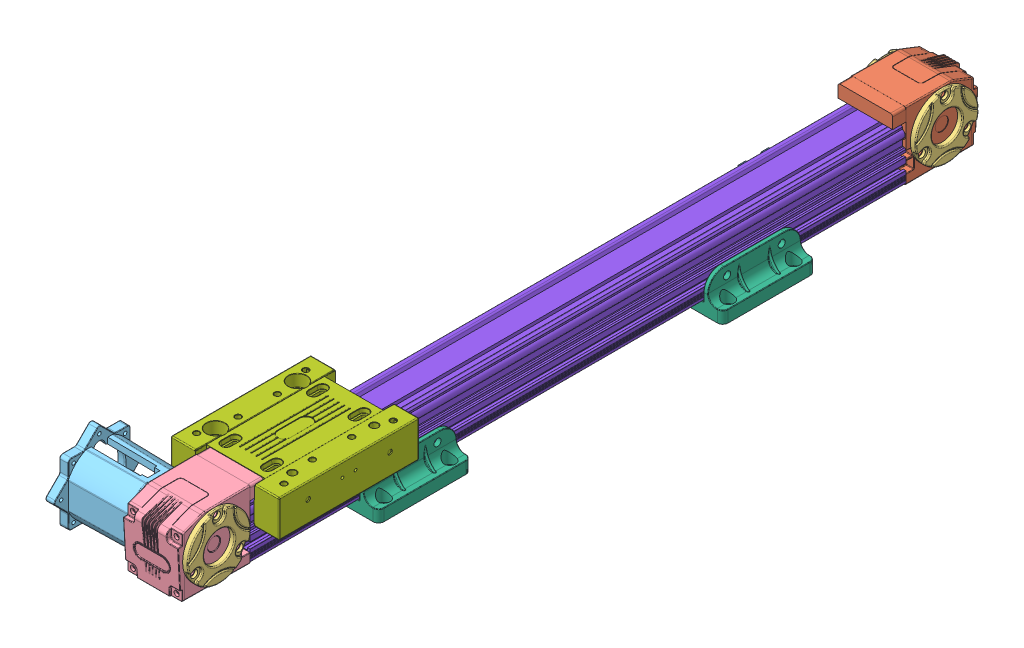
SolidWorks assembly RYK50M-直连.SLDASM, configuration 默认 (file format 9000). Lengths in mm.
Overall size (137.72 84.04 746.8).
23 component instances, 13 part files, 68 mates.
Components (placement in the parent):
- 674光电组合-1: 674光电组合.SLDPRT [默认] at (26.3809 31.9139 -239.3773) size (22 20 55.4)
- RYK50M 副同步轮座-1: RYK50M 副同步轮座.SLDPRT [默认] at (26.3809 32.4139 -488.4984) size (50.27 62 79.8)
- RYK50欧规皮带模组轴承压盖-3: RYK50欧规皮带模组轴承压盖.SLDPRT [默认] at (48.3271 48.6111 -271.48) x (0 0.866025 -0.5) z (-1 0 0) size (57.5 57.5 5)
- RYK50欧规皮带模组轴承压盖-4: RYK50欧规皮带模组轴承压盖.SLDPRT [默认] at (-11.6729 48.6111 -271.48) x (0 0 -1) z (1 0 0) size (57.5 57.5 5)
- RYK50M 欧规主同步轮座-1A出轴-1: RYK50M 欧规主同步轮座-1A出轴.SLDPRT [默认] at (26.3809 32.4139 -335.4984) size (80.07 62 79.8)
- RYK50欧规皮带模组轴承压盖-2: RYK50欧规皮带模组轴承压盖.SLDPRT [默认] at (48.3271 48.643 394.5016) x (0 0.866025 -0.5) z (-1 0 0) size (57.5 57.5 5)
- 57-60电机座-2: 57-60电机座.SLDPRT [默认] at (-9.5729 48.643 394.5016) x (0 0 -1) z (-1 0 0) size (83.09 83.08 62.81)
- RYK50M 欧规主同步轮座-2B出轴-1: RYK50M 欧规主同步轮座-2B出轴.SLDPRT [默认] at (26.3809 32.4139 -335.4984) (suppressed, hidden)
- RYK50欧规皮带模组轴承压盖-1: RYK50欧规皮带模组轴承压盖.SLDPRT [默认] at (-11.6729 48.643 394.5016) x (0 0 -1) z (1 0 0) size (57.5 57.5 5) (suppressed, hidden)
- 57-60电机座-1: 57-60电机座.SLDPRT [默认] at (46.2271 48.6111 394.4832) x (0 -0.707107 0.707107) z (1 0 0) size (83.09 83.08 62.81) (suppressed, hidden)
- RYK50M 欧规主同步轮座-双出轴-1: RYK50M 欧规主同步轮座-双出轴.SLDPRT [默认] at (26.3809 32.4139 -335.4984) (suppressed, hidden)
- 57-60电机座-3: 57-60电机座.SLDPRT [默认] at (46.2271 48.6111 394.4832) x (0 0 1) z (1 0 0) size (83.09 83.08 62.81) (suppressed, hidden)
- RYK50欧规皮带模组轴承压盖-6: RYK50欧规皮带模组轴承压盖.SLDPRT [默认] at (-11.6729 48.643 394.5016) x (0 0 -1) z (1 0 0) size (57.5 57.5 5) (suppressed, hidden)
- RYK50欧规皮带模组轴承压盖-7: RYK50欧规皮带模组轴承压盖.SLDPRT [默认] at (48.3271 48.643 394.5016) x (0 0.866025 -0.5) z (-1 0 0) size (57.5 57.5 5) (suppressed, hidden)
- 57-60电机座-4: 57-60电机座.SLDPRT [默认] at (-9.5729 48.6111 394.4832) x (0 0 -1) z (-1 0 0) size (83.09 83.08 62.81) (suppressed, hidden)
- RYK50M-地脚-1: RYK50M-地脚.SLDPRT [默认] at (18.3271 11.893 219.0016) size (85 33 85)
- RYK50M-滑块-1: RYK50M-滑块.SLDPRT [默认] at (13.8037 62.1583 179.5016) size (99.83 33.95 128.24)
- RYK50M-型材底座-1: RYK50M-型材底座.SLDPRT [默认] at (-7.6857 29.6308 -238.4984) size (50 47 600)
- RYK50M-地脚-2: RYK50M-地脚.SLDPRT [默认] at (18.3271 11.893 -95.9984) size (85 33 85)
- 674光电组合-2: 674光电组合.SLDPRT [默认] at (26.3809 31.9139 -714.3773) size (22 20 55.4)
- RYK50-光电片-1: RYK50-光电片.SLDPRT [默认] at (-32.1729 74.643 305.5016) x (0 0 -1) z (1 0 0) size (20 47 12)
- 86电机转接板-M5-1: 86电机转接板-M5.SLDPRT [默认] at (-69.8759 49.5703 392.6045) x (0 0 1) z (-1 0 0) (suppressed, hidden)
- 750W电机标准转接板-1: 750W电机标准转接板.SLDPRT [默认] at (-69.4729 48.643 394.5016) x (0 1 0) z (0 0 1) (suppressed, hidden)
Mates (geometry in assembly coordinates):
- 重合1: coincident anti-aligned: plane of RYK50M 副同步轮座-1 through (43.3271 78.643 -238.4984) normal (0 0 1); plane of RYK50M-型材底座-1 through (-3.4729 51.6832 -238.4984) normal (0 0 -1)
- 宽度1: width aligned: plane of RYK50M-型材底座-1 through (43.3271 38.837 361.5016) normal (1 0 0); plane of RYK50M-型材底座-1 through (-6.6729 38.837 361.5016) normal (-1 0 0); plane of RYK50M 副同步轮座-1 through (43.3271 16.643 -238.4984) normal (1 0 0); plane of RYK50M 副同步轮座-1 through (-6.6729 16.643 -238.4984) normal (-1 0 0)
- 重合3: coincident: line of RYK50M 副同步轮座-1 through (30.8305 16.643 -238.4984) axis (-1 0 0); plane of RYK50M-型材底座-1 through (3.2771 16.643 361.5016) normal (0 -1 0)
- 宽度2: width anti-aligned: plane of RYK50M-型材底座-1 through (-6.6729 38.837 361.5016) normal (-1 0 0); plane of RYK50M-型材底座-1 through (43.3271 38.837 361.5016) normal (1 0 0); plane of RYK50M 欧规主同步轮座-双出轴-1 through (43.3271 16.643 361.5016) normal (1 0 0); plane of RYK50M 欧规主同步轮座-双出轴-1 through (-6.6729 16.643 361.5016) normal (-1 0 0)
- 重合4: coincident anti-aligned: plane of RYK50M 欧规主同步轮座-双出轴-1 through (-6.6729 78.643 361.5016) normal (0 0 -1); plane of RYK50M-型材底座-1 through (-3.4729 51.6832 361.5016) normal (0 0 1)
- 重合5: coincident: line of RYK50M 欧规主同步轮座-双出轴-1 through (5.8238 16.643 361.5016) axis (1 0 0); plane of RYK50M-型材底座-1 through (3.2771 16.643 361.5016) normal (0 -1 0)
- 宽度3: width aligned: plane of RYK50M-型材底座-1 through (-6.6729 38.837 361.5016) normal (-1 0 0); plane of RYK50M-型材底座-1 through (43.3271 38.837 361.5016) normal (1 0 0); plane of RYK50M 欧规主同步轮座-2B出轴-1 through (-6.6729 16.643 361.5016) normal (-1 0 0); plane of RYK50M 欧规主同步轮座-2B出轴-1 through (43.3271 16.643 361.5016) normal (1 0 0)
- 重合6: coincident: line of RYK50M 欧规主同步轮座-2B出轴-1 through (5.8238 16.643 361.5016) axis (1 0 0); plane of RYK50M-型材底座-1 through (33.3771 16.643 361.5016) normal (0 -1 0)
- 重合7: coincident anti-aligned: plane of RYK50M 欧规主同步轮座-2B出轴-1 through (-6.6729 78.643 361.5016) normal (0 0 -1); plane of RYK50M-型材底座-1 through (-3.4729 51.6832 361.5016) normal (0 0 1)
- 宽度4: width anti-aligned: plane of RYK50M-型材底座-1 through (43.3271 38.837 361.5016) normal (1 0 0); plane of RYK50M-型材底座-1 through (-6.6729 38.837 361.5016) normal (-1 0 0); plane of RYK50M-地脚-1 through (43.3271 16.643 261.5016) normal (-1 0 0); plane of RYK50M-地脚-1 through (-6.6729 16.643 261.5016) normal (1 0 0)
- 重合8: coincident anti-aligned: plane of RYK50M-地脚-1 through (-6.6729 16.643 261.5016) normal (0 1 0); plane of RYK50M-型材底座-1 through (3.2771 16.643 361.5016) normal (0 -1 0)
- 距离1: distance = 100 mm aligned: plane of RYK50M-型材底座-1 through (-3.4729 51.6832 361.5016) normal (0 0 1); plane of RYK50M-地脚-1 through (-18.6729 25.143 261.5016) normal (0 0 1)
- 宽度5: width aligned: plane of RYK50M-型材底座-1 through (-6.6729 38.837 361.5016) normal (-1 0 0); plane of RYK50M-型材底座-1 through (43.3271 38.837 361.5016) normal (1 0 0); plane of RYK50M 欧规主同步轮座-1A出轴-1 through (-6.6729 16.643 361.5016) normal (-1 0 0); plane of RYK50M 欧规主同步轮座-1A出轴-1 through (43.3271 16.643 361.5016) normal (1 0 0)
- 重合10: coincident anti-aligned: plane of RYK50M 欧规主同步轮座-1A出轴-1 through (-6.6729 78.643 361.5016) normal (0 0 -1); plane of RYK50M-型材底座-1 through (-3.4729 51.6832 361.5016) normal (0 0 1)
- 重合11: coincident: line of RYK50M 欧规主同步轮座-1A出轴-1 through (5.8238 16.643 361.5016) axis (1 0 0); plane of RYK50M-型材底座-1 through (33.3771 16.643 361.5016) normal (0 -1 0)
- 宽度6: width aligned: plane of RYK50M-滑块-1 through (-31.1729 46.043 88.9576) normal (-1 0 0); plane of RYK50M-滑块-1 through (67.8271 46.043 88.9576) normal (1 0 0); plane of RYK50M-型材底座-1 through (-6.6729 38.837 361.5016) normal (-1 0 0); plane of RYK50M-型材底座-1 through (43.3271 38.837 361.5016) normal (1 0 0)
- 距离2: distance = 73.5 mm anti-aligned: plane of RYK50M-地脚-1 through (60.8271 6.143 261.5016) normal (0 -1 0); plane of RYK50M-滑块-1 through (18.3271 79.643 305.5016) normal (0 1 0)
- 重合13: coincident anti-aligned: plane of 674光电组合-1 through (-6.6729 39.643 331.5016) normal (1 0 0); plane of RYK50M-型材底座-1 through (-6.6729 38.837 361.5016) normal (-1 0 0)
- 距离3: distance = 3 mm aligned: plane of 674光电组合-1 through (-6.6729 19.643 331.5016) normal (0 -1 0); plane of RYK50M-型材底座-1 through (3.2771 16.643 361.5016) normal (0 -1 0)
- 重合15: coincident anti-aligned: plane of RYK50M 欧规主同步轮座-1A出轴-1 through (18.3271 63.5276 349.5016) normal (0 0 -1); plane of RYK50M-滑块-1 through (-8.6729 60.543 349.5016) normal (0 0 1)
- 重合16: coincident aligned: plane of RYK50M-地脚-1 through (6.3271 6.143 261.5016) normal (0 -1 0); plane of RYK50M-地脚-2 through (6.3271 6.143 -53.4984) normal (0 -1 0)
- 重合17: coincident aligned: plane of RYK50M-地脚-1 through (-24.1729 17.143 261.5016) normal (-1 0 0); plane of RYK50M-地脚-2 through (-24.1729 17.143 -53.4984) normal (-1 0 0)
- 距离4: distance = 100 mm anti-aligned: plane of RYK50M-地脚-2 through (-18.6729 25.143 -138.4984) normal (0 0 -1); plane of RYK50M 副同步轮座-1 through (43.3271 78.643 -238.4984) normal (0 0 1)
- 重合20: coincident anti-aligned: plane of RYK50M 欧规主同步轮座-1A出轴-1 through (43.3271 16.643 361.5016) normal (1 0 0); plane of RYK50欧规皮带模组轴承压盖-2 through (43.3271 48.643 394.5016) normal (-1 0 0)
- 同心2: concentric aligned: circle of RYK50M 欧规主同步轮座-1A出轴-1; circle of RYK50欧规皮带模组轴承压盖-2
- 同心3: concentric aligned: cylinder of RYK50M 欧规主同步轮座-1A出轴-1 through (43.3271 72.643 394.5016) axis (1 0 0) radius 2.5; cylinder of RYK50欧规皮带模组轴承压盖-2 through (48.3271 72.643 394.5016) axis (1 0 0) radius 3.3
- 重合21: coincident anti-aligned: plane of RYK50M 副同步轮座-1 through (43.3271 16.643 -238.4984) normal (1 0 0); plane of RYK50欧规皮带模组轴承压盖-3 through (43.3271 48.6111 -271.48) normal (-1 0 0)
- 同心4: concentric anti-aligned: circle of RYK50M 副同步轮座-1; cylinder of RYK50欧规皮带模组轴承压盖-3 through (43.3271 48.6111 -271.48) axis (1 0 0) radius 14
- 平行2: parallel anti-aligned: cylinder of RYK50M 副同步轮座-1 through (43.3271 72.643 -271.4984) axis (-1 0 0) radius 2.5; cylinder of RYK50欧规皮带模组轴承压盖-3 through (48.3271 72.6111 -271.48) axis (1 0 0) radius 3.3
- 同心6: concentric anti-aligned: circle of RYK50M 副同步轮座-1; circle of RYK50欧规皮带模组轴承压盖-4
- 重合22: coincident anti-aligned: plane of RYK50M 副同步轮座-1 through (-6.6729 16.643 -238.4984) normal (-1 0 0); plane of RYK50欧规皮带模组轴承压盖-4 through (-6.6729 48.6111 -271.48) normal (1 0 0)
- 平行3: parallel aligned: cylinder of RYK50M 副同步轮座-1 through (-6.6729 72.643 -271.4984) axis (-1 0 0) radius 2.5; cylinder of RYK50欧规皮带模组轴承压盖-4 through (-11.6729 72.6111 -271.48) axis (-1 0 0) radius 3.3
- 重合23: coincident anti-aligned: plane of RYK50M-型材底座-1 through (-6.6729 38.837 361.5016) normal (-1 0 0); plane of 674光电组合-2 through (-6.6729 39.643 -143.4984) normal (1 0 0)
- 重合24: coincident aligned: plane of 674光电组合-1 through (-8.6729 39.643 331.5016) normal (0 1 0); plane of 674光电组合-2 through (-8.6729 39.643 -143.4984) normal (0 1 0)
- 距离5: distance = 40 mm aligned: plane of 674光电组合-2 through (-9.4095 22.3796 -198.4984) normal (0 0 -1); plane of RYK50M-型材底座-1 through (-3.4729 51.6832 -238.4984) normal (0 0 -1)
- 重合33: coincident anti-aligned: plane of RYK50M 欧规主同步轮座-2B出轴-1 through (43.3271 16.643 361.5016) normal (1 0 0); plane of 57-60电机座-1 through (43.3271 48.6111 394.4832) normal (-1 0 0)
- 同心8: concentric anti-aligned: cylinder of RYK50M 欧规主同步轮座-2B出轴-1 through (42.3271 48.6111 394.4832) axis (-1 0 0) radius 6; cone of 57-60电机座-1 through (53.2271 48.6111 394.4832) axis (1 0 0)
- 平行5: parallel anti-aligned: cylinder of RYK50M 欧规主同步轮座-2B出轴-1 through (43.3271 54.6022 371.2661) axis (1 0 0) radius 2.5; cone of 57-60电机座-1 through (43.2271 54.6202 371.2477) axis (-1 0 0)
- 平行8: parallel: plane of RYK50M-滑块-1 through (18.3271 79.643 305.5016) normal (0 1 0); line of 57-60电机座-1 through (106.1271 78.4023 367.4832) axis (0 0 1)
- 重合37: coincident anti-aligned: plane of RYK50M 欧规主同步轮座-2B出轴-1 through (-6.6729 16.643 361.5016) normal (-1 0 0); plane of 57-60电机座-2 through (-6.6729 48.643 394.5016) normal (1 0 0)
- 重合40: coincident anti-aligned: plane of RYK50M-滑块-1 through (-31.1729 46.043 88.9576) normal (-1 0 0); plane of RYK50-光电片-1 through (-31.1729 74.643 285.5016) normal (1 0 0)
- 宽度10: width aligned: plane of RYK50M-滑块-1 through (-32.1729 72.243 359.5016) normal (0 0 1); plane of RYK50M-滑块-1 through (-32.1729 72.243 231.5016) normal (0 0 -1); plane of RYK50-光电片-1 through (-30.4363 40.643 305.5016) normal (0 0 1); plane of RYK50-光电片-1 through (-21.9095 38.9064 285.5016) normal (0 0 -1)
- 距离6: distance = 5 mm aligned: plane of RYK50-光电片-1 through (-31.1729 74.643 285.5016) normal (0 1 0); plane of RYK50M-滑块-1 through (18.3271 79.643 305.5016) normal (0 1 0)
- 同心11: concentric anti-aligned: cylinder of 57-60电机座-2 through (-63.5729 48.643 394.5016) axis (-1 0 0) radius 25; cylinder of 750W电机标准转接板-1 through (-117.4729 48.643 394.5016) axis (1 0 0) radius 22.5
- 重合41: coincident anti-aligned: plane of 57-60电机座-2 through (-69.4729 48.643 394.5016) normal (-1 0 0); plane of 750W电机标准转接板-1 through (-69.4729 48.643 394.5016) normal (1 0 0)
- 同心12: concentric aligned: cylinder of 57-60电机座-2 through (-63.5729 48.643 394.5016) axis (-1 0 0) radius 25; cylinder of 86电机转接板-M5-1 through (-67.4729 48.643 394.5016) axis (-1 0 0) radius 25
- 重合42: coincident anti-aligned: plane of 57-60电机座-2 through (-69.4729 48.643 394.5016) normal (-1 0 0); plane of 86电机转接板-M5-1 through (-69.4729 8.643 434.5016) normal (1 0 0)
- 平行11: parallel: line of 57-60电机座-2 through (-69.4729 76.9342 379.3326) axis (0 0 -1); plane of RYK50M-滑块-1 through (18.3271 79.643 305.5016) normal (0 1 0)
- 距离7: distance = 30 mm aligned: plane of 674光电组合-1 through (-8.6729 22.3796 331.5016) normal (0 0 1); plane of RYK50M-型材底座-1 through (-3.4729 51.6832 361.5016) normal (0 0 1)
- 同心13: concentric anti-aligned: cylinder of RYK50M 欧规主同步轮座-1A出轴-1 through (-6.1229 48.643 394.5016) axis (1 0 0) radius 6; cone of 57-60电机座-2 through (-16.5729 48.643 394.5016) axis (-1 0 0)
- 重合43: coincident anti-aligned: plane of RYK50M 欧规主同步轮座-1A出轴-1 through (-6.6729 16.643 361.5016) normal (-1 0 0); plane of 57-60电机座-2 through (-6.6729 48.643 394.5016) normal (1 0 0)
- 重合44: coincident anti-aligned: plane of RYK50M 欧规主同步轮座-双出轴-1 through (-6.6729 16.643 361.5016) normal (-1 0 0); plane of RYK50欧规皮带模组轴承压盖-6 through (-6.6729 48.643 394.5016) normal (1 0 0)
- 同心18: concentric anti-aligned: circle of RYK50M 欧规主同步轮座-双出轴-1; circle of RYK50欧规皮带模组轴承压盖-6
- 同心19: concentric anti-aligned: circle of RYK50M 欧规主同步轮座-双出轴-1; circle of RYK50欧规皮带模组轴承压盖-6
- 重合46: coincident anti-aligned: plane of RYK50M 欧规主同步轮座-双出轴-1 through (-6.6729 16.643 361.5016) normal (-1 0 0); plane of 57-60电机座-4 through (-6.6729 48.6111 394.4832) normal (1 0 0)
- 同心20: concentric anti-aligned: cylinder of RYK50M 欧规主同步轮座-双出轴-1 through (-5.6729 48.6111 394.4832) axis (1 0 0) radius 6; cone of 57-60电机座-4 through (-16.5729 48.6111 394.4832) axis (-1 0 0)
- 平行17: parallel: plane of RYK50M-滑块-1 through (18.3271 79.643 305.5016) normal (0 1 0); line of 57-60电机座-4 through (-62.0641 76.9801 368.9832) axis (0 0 1)
- 重合50: coincident anti-aligned: plane of RYK50M 欧规主同步轮座-双出轴-1 through (43.3271 16.643 361.5016) normal (1 0 0); plane of 57-60电机座-3 through (43.3271 48.6111 394.4832) normal (-1 0 0)
- 同心22: concentric anti-aligned: cylinder of RYK50M 欧规主同步轮座-双出轴-1 through (42.3271 48.6111 394.4832) axis (-1 0 0) radius 6; cone of 57-60电机座-3 through (53.2271 48.6111 394.4832) axis (1 0 0)
- 平行18: parallel: plane of RYK50M-滑块-1 through (18.3271 79.643 305.5016) normal (0 1 0); line of 57-60电机座-3 through (105.7184 77.1022 379.3142) axis (0 0 -1)
- 重合52: coincident anti-aligned: plane of RYK50M 欧规主同步轮座-双出轴-1 through (43.3271 16.643 361.5016) normal (1 0 0); plane of RYK50欧规皮带模组轴承压盖-7 through (43.3271 48.643 394.5016) normal (-1 0 0)
- 同心23: concentric aligned: circle of RYK50M 欧规主同步轮座-双出轴-1; cylinder of RYK50欧规皮带模组轴承压盖-7 through (48.3271 72.643 394.5016) axis (1 0 0) radius 3.3
- 同心24: concentric aligned: cylinder of RYK50M 欧规主同步轮座-双出轴-1 through (43.3271 36.643 415.2862) axis (1 0 0) radius 2.5; cylinder of RYK50欧规皮带模组轴承压盖-7 through (48.3271 36.643 415.2862) axis (1 0 0) radius 3.3
- 同心25: concentric anti-aligned: cylinder of RYK50M 欧规主同步轮座-2B出轴-1 through (-6.6729 72.643 394.5016) axis (1 0 0) radius 2.5; cylinder of RYK50欧规皮带模组轴承压盖-1 through (-11.6729 72.643 394.5016) axis (-1 0 0) radius 3.3
- 同心26: concentric anti-aligned: cylinder of RYK50M 欧规主同步轮座-2B出轴-1 through (-6.6729 36.643 415.2862) axis (1 0 0) radius 2.5; cylinder of RYK50欧规皮带模组轴承压盖-1 through (-11.6729 36.643 415.2862) axis (-1 0 0) radius 3.3
- 重合53: coincident anti-aligned: plane of RYK50M 欧规主同步轮座-2B出轴-1 through (-6.6729 16.643 361.5016) normal (-1 0 0); plane of RYK50欧规皮带模组轴承压盖-1 through (-6.6729 48.643 394.5016) normal (1 0 0)
- 重合54: coincident anti-aligned: plane of RYK50M 欧规主同步轮座-2B出轴-1 through (18.3271 63.593 349.5016) normal (0 0 -1); plane of RYK50M-滑块-1 through (-8.6729 60.543 349.5016) normal (0 0 1)
- 重合55: coincident anti-aligned: plane of RYK50M 欧规主同步轮座-双出轴-1 through (18.3271 63.593 349.5016) normal (0 0 -1); plane of RYK50M-滑块-1 through (-8.6729 60.543 349.5016) normal (0 0 1)
